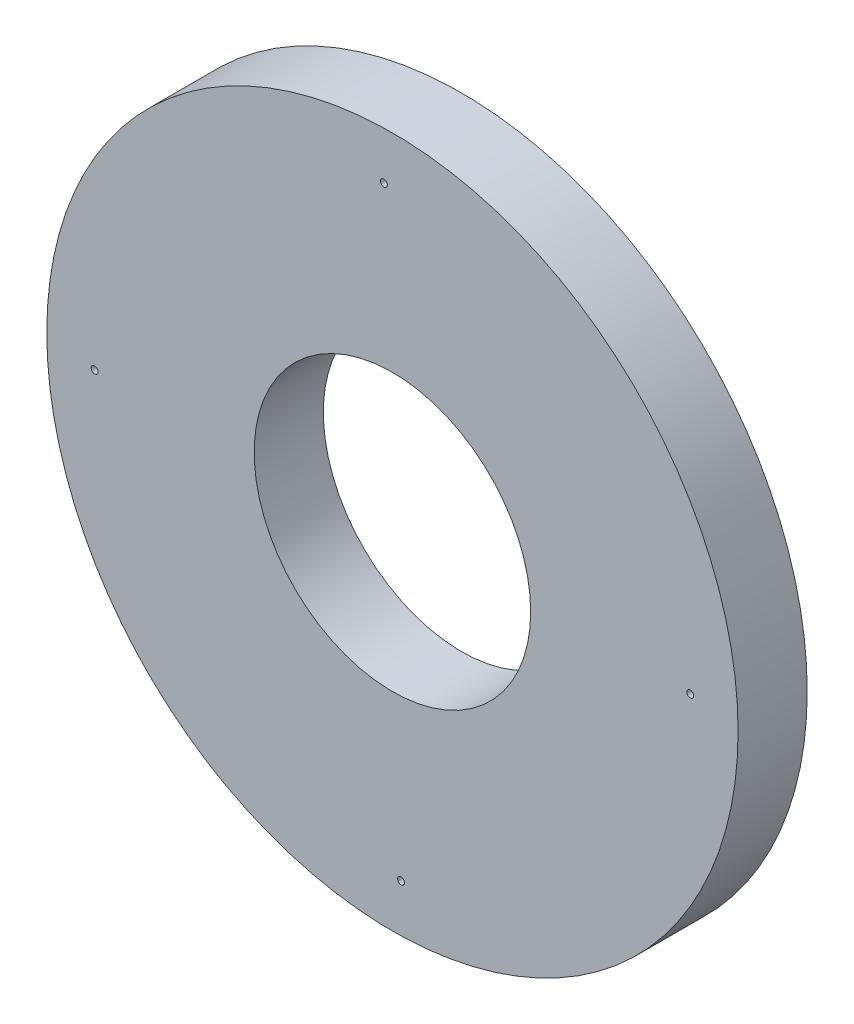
ISO-10303-21;
HEADER;
FILE_DESCRIPTION(('STEP AP214'),'2;1');
FILE_NAME('part.step','',(''),(''),'','','');
FILE_SCHEMA(('AUTOMOTIVE_DESIGN { 1 0 10303 214 1 1 1 1 }'));
ENDSEC;
DATA;
#1=APPLICATION_CONTEXT('core data for automotive mechanical design processes');
#2=APPLICATION_PROTOCOL_DEFINITION('international standard','automotive_design',2000,#1);
#3=PRODUCT_CONTEXT('',#1,'mechanical');
#4=PRODUCT('Part','Part','',(#3));
#5=PRODUCT_RELATED_PRODUCT_CATEGORY('part','',(#4));
#6=PRODUCT_DEFINITION_FORMATION('','',#4);
#7=PRODUCT_DEFINITION_CONTEXT('part definition',#1,'design');
#8=PRODUCT_DEFINITION('design','',#6,#7);
#9=PRODUCT_DEFINITION_SHAPE('','',#8);
#10=(LENGTH_UNIT() NAMED_UNIT(*) SI_UNIT(.MILLI.,.METRE.));
#11=(NAMED_UNIT(*) PLANE_ANGLE_UNIT() SI_UNIT($,.RADIAN.));
#12=(NAMED_UNIT(*) SI_UNIT($,.STERADIAN.) SOLID_ANGLE_UNIT());
#13=UNCERTAINTY_MEASURE_WITH_UNIT(LENGTH_MEASURE(1.E-05),#10,'distance_accuracy_value','');
#14=(GEOMETRIC_REPRESENTATION_CONTEXT(3) GLOBAL_UNCERTAINTY_ASSIGNED_CONTEXT((#13)) GLOBAL_UNIT_ASSIGNED_CONTEXT((#10,
#11,#12)) REPRESENTATION_CONTEXT('',''));
#15=CARTESIAN_POINT('',(0.,0.,0.));
#16=DIRECTION('',(0.,0.,1.));
#17=DIRECTION('',(1.,0.,0.));
#18=AXIS2_PLACEMENT_3D('',#15,#16,#17);
#19=CARTESIAN_POINT('',(-8.36808169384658,3.175,6.35));
#20=DIRECTION('',(0.,0.,1.));
#21=DIRECTION('',(1.,0.,0.));
#22=AXIS2_PLACEMENT_3D('',#19,#20,#21);
#23=PLANE('',#22);
#24=CARTESIAN_POINT('',(-9.15683678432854,30.5321317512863,6.35));
#25=DIRECTION('',(0.,0.,1.));
#26=DIRECTION('',(1.,0.,0.));
#27=AXIS2_PLACEMENT_3D('',#24,#25,#26);
#28=CIRCLE('',#27,0.317500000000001);
#29=CARTESIAN_POINT('',(-8.83933678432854,30.5321317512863,6.35));
#30=VERTEX_POINT('',#29);
#31=EDGE_CURVE('E59',#30,#30,#28,.T.);
#32=ORIENTED_EDGE('',*,*,#31,.F.);
#33=EDGE_LOOP('',(#32));
#34=FACE_BOUND('',#33,.T.);
#35=CARTESIAN_POINT('',(-7.57932660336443,-24.1821317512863,6.35));
#36=DIRECTION('',(0.,0.,1.));
#37=DIRECTION('',(1.,0.,0.));
#38=AXIS2_PLACEMENT_3D('',#35,#36,#37);
#39=CIRCLE('',#38,0.317500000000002);
#40=CARTESIAN_POINT('',(-7.26182660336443,-24.1821317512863,6.35));
#41=VERTEX_POINT('',#40);
#42=EDGE_CURVE('E47',#41,#41,#39,.T.);
#43=ORIENTED_EDGE('',*,*,#42,.F.);
#44=EDGE_LOOP('',(#43));
#45=FACE_BOUND('',#44,.T.);
#46=CARTESIAN_POINT('',(-8.36808169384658,3.175,6.35));
#47=DIRECTION('',(0.,0.,1.));
#48=DIRECTION('',(1.,0.,0.));
#49=AXIS2_PLACEMENT_3D('',#46,#47,#48);
#50=CIRCLE('',#49,31.75);
#51=CARTESIAN_POINT('',(23.3819183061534,3.175,6.35));
#52=VERTEX_POINT('',#51);
#53=EDGE_CURVE('E10',#52,#52,#50,.T.);
#54=ORIENTED_EDGE('',*,*,#53,.T.);
#55=EDGE_LOOP('',(#54));
#56=FACE_BOUND('',#55,.T.);
#57=CARTESIAN_POINT('',(-8.36808169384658,3.175,6.35));
#58=DIRECTION('',(0.,0.,1.));
#59=DIRECTION('',(1.,0.,0.));
#60=AXIS2_PLACEMENT_3D('',#57,#58,#59);
#61=CIRCLE('',#60,12.7);
#62=CARTESIAN_POINT('',(4.33191830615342,3.175,6.35));
#63=VERTEX_POINT('',#62);
#64=EDGE_CURVE('E42',#63,#63,#61,.T.);
#65=ORIENTED_EDGE('',*,*,#64,.F.);
#66=EDGE_LOOP('',(#65));
#67=FACE_BOUND('',#66,.T.);
#68=CARTESIAN_POINT('',(-35.7252134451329,2.38624490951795,6.35));
#69=DIRECTION('',(0.,0.,1.));
#70=DIRECTION('',(1.,0.,0.));
#71=AXIS2_PLACEMENT_3D('',#68,#69,#70);
#72=CIRCLE('',#71,0.317500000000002);
#73=CARTESIAN_POINT('',(-35.4077134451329,2.38624490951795,6.35));
#74=VERTEX_POINT('',#73);
#75=EDGE_CURVE('E53',#74,#74,#72,.T.);
#76=ORIENTED_EDGE('',*,*,#75,.F.);
#77=EDGE_LOOP('',(#76));
#78=FACE_BOUND('',#77,.T.);
#79=CARTESIAN_POINT('',(18.9890500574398,3.96375509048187,6.35));
#80=DIRECTION('',(0.,0.,1.));
#81=DIRECTION('',(1.,0.,0.));
#82=AXIS2_PLACEMENT_3D('',#79,#80,#81);
#83=CIRCLE('',#82,0.317500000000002);
#84=CARTESIAN_POINT('',(19.3065500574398,3.96375509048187,6.35));
#85=VERTEX_POINT('',#84);
#86=EDGE_CURVE('E65',#85,#85,#83,.T.);
#87=ORIENTED_EDGE('',*,*,#86,.F.);
#88=EDGE_LOOP('',(#87));
#89=FACE_BOUND('',#88,.T.);
#90=ADVANCED_FACE('F31',(#34,#45,#56,#67,#78,#89),#23,.T.);
#91=CARTESIAN_POINT('',(-8.36808169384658,3.175,0.));
#92=DIRECTION('',(0.,0.,1.));
#93=DIRECTION('',(1.,0.,0.));
#94=AXIS2_PLACEMENT_3D('',#91,#92,#93);
#95=PLANE('',#94);
#96=CARTESIAN_POINT('',(-9.15683678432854,30.5321317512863,0.));
#97=DIRECTION('',(0.,0.,1.));
#98=DIRECTION('',(1.,0.,0.));
#99=AXIS2_PLACEMENT_3D('',#96,#97,#98);
#100=CIRCLE('',#99,0.317500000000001);
#101=CARTESIAN_POINT('',(-8.83933678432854,30.5321317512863,0.));
#102=VERTEX_POINT('',#101);
#103=EDGE_CURVE('E62',#102,#102,#100,.T.);
#104=ORIENTED_EDGE('',*,*,#103,.T.);
#105=EDGE_LOOP('',(#104));
#106=FACE_BOUND('',#105,.T.);
#107=CARTESIAN_POINT('',(-7.57932660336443,-24.1821317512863,0.));
#108=DIRECTION('',(0.,0.,1.));
#109=DIRECTION('',(1.,0.,0.));
#110=AXIS2_PLACEMENT_3D('',#107,#108,#109);
#111=CIRCLE('',#110,0.317500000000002);
#112=CARTESIAN_POINT('',(-7.26182660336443,-24.1821317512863,0.));
#113=VERTEX_POINT('',#112);
#114=EDGE_CURVE('E50',#113,#113,#111,.T.);
#115=ORIENTED_EDGE('',*,*,#114,.T.);
#116=EDGE_LOOP('',(#115));
#117=FACE_BOUND('',#116,.T.);
#118=CARTESIAN_POINT('',(-8.36808169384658,3.175,0.));
#119=DIRECTION('',(0.,0.,1.));
#120=DIRECTION('',(1.,0.,0.));
#121=AXIS2_PLACEMENT_3D('',#118,#119,#120);
#122=CIRCLE('',#121,31.75);
#123=CARTESIAN_POINT('',(23.3819183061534,3.175,0.));
#124=VERTEX_POINT('',#123);
#125=EDGE_CURVE('E35',#124,#124,#122,.T.);
#126=ORIENTED_EDGE('',*,*,#125,.F.);
#127=EDGE_LOOP('',(#126));
#128=FACE_BOUND('',#127,.T.);
#129=CARTESIAN_POINT('',(-8.36808169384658,3.175,0.));
#130=DIRECTION('',(0.,0.,1.));
#131=DIRECTION('',(1.,0.,0.));
#132=AXIS2_PLACEMENT_3D('',#129,#130,#131);
#133=CIRCLE('',#132,12.7);
#134=CARTESIAN_POINT('',(4.33191830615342,3.175,0.));
#135=VERTEX_POINT('',#134);
#136=EDGE_CURVE('E44',#135,#135,#133,.T.);
#137=ORIENTED_EDGE('',*,*,#136,.T.);
#138=EDGE_LOOP('',(#137));
#139=FACE_BOUND('',#138,.T.);
#140=CARTESIAN_POINT('',(-35.7252134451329,2.38624490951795,0.));
#141=DIRECTION('',(0.,0.,1.));
#142=DIRECTION('',(1.,0.,0.));
#143=AXIS2_PLACEMENT_3D('',#140,#141,#142);
#144=CIRCLE('',#143,0.317500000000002);
#145=CARTESIAN_POINT('',(-35.4077134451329,2.38624490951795,0.));
#146=VERTEX_POINT('',#145);
#147=EDGE_CURVE('E56',#146,#146,#144,.T.);
#148=ORIENTED_EDGE('',*,*,#147,.T.);
#149=EDGE_LOOP('',(#148));
#150=FACE_BOUND('',#149,.T.);
#151=CARTESIAN_POINT('',(18.9890500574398,3.96375509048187,0.));
#152=DIRECTION('',(0.,0.,1.));
#153=DIRECTION('',(1.,0.,0.));
#154=AXIS2_PLACEMENT_3D('',#151,#152,#153);
#155=CIRCLE('',#154,0.317500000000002);
#156=CARTESIAN_POINT('',(19.3065500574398,3.96375509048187,0.));
#157=VERTEX_POINT('',#156);
#158=EDGE_CURVE('E68',#157,#157,#155,.T.);
#159=ORIENTED_EDGE('',*,*,#158,.T.);
#160=EDGE_LOOP('',(#159));
#161=FACE_BOUND('',#160,.T.);
#162=ADVANCED_FACE('F78',(#106,#117,#128,#139,#150,#161),#95,.F.);
#163=CARTESIAN_POINT('',(-8.36808169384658,3.175,6.35));
#164=DIRECTION('',(0.,0.,-1.));
#165=DIRECTION('',(-1.,0.,0.));
#166=AXIS2_PLACEMENT_3D('',#163,#164,#165);
#167=CYLINDRICAL_SURFACE('',#166,31.75);
#168=ORIENTED_EDGE('',*,*,#53,.F.);
#169=EDGE_LOOP('',(#168));
#170=FACE_BOUND('',#169,.T.);
#171=ORIENTED_EDGE('',*,*,#125,.T.);
#172=EDGE_LOOP('',(#171));
#173=FACE_BOUND('',#172,.T.);
#174=ADVANCED_FACE('F33',(#170,#173),#167,.T.);
#175=CARTESIAN_POINT('',(-8.36808169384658,3.175,6.35));
#176=DIRECTION('',(0.,0.,-1.));
#177=DIRECTION('',(-1.,0.,0.));
#178=AXIS2_PLACEMENT_3D('',#175,#176,#177);
#179=CYLINDRICAL_SURFACE('',#178,12.7);
#180=ORIENTED_EDGE('',*,*,#64,.T.);
#181=EDGE_LOOP('',(#180));
#182=FACE_BOUND('',#181,.T.);
#183=ORIENTED_EDGE('',*,*,#136,.F.);
#184=EDGE_LOOP('',(#183));
#185=FACE_BOUND('',#184,.T.);
#186=ADVANCED_FACE('F88',(#182,#185),#179,.F.);
#187=CARTESIAN_POINT('',(-7.57932660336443,-24.1821317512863,6.35));
#188=DIRECTION('',(0.,0.,-1.));
#189=DIRECTION('',(-1.,0.,0.));
#190=AXIS2_PLACEMENT_3D('',#187,#188,#189);
#191=CYLINDRICAL_SURFACE('',#190,0.317500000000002);
#192=ORIENTED_EDGE('',*,*,#42,.T.);
#193=EDGE_LOOP('',(#192));
#194=FACE_BOUND('',#193,.T.);
#195=ORIENTED_EDGE('',*,*,#114,.F.);
#196=EDGE_LOOP('',(#195));
#197=FACE_BOUND('',#196,.T.);
#198=ADVANCED_FACE('F91',(#194,#197),#191,.F.);
#199=CARTESIAN_POINT('',(-35.7252134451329,2.38624490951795,6.35));
#200=DIRECTION('',(0.,0.,-1.));
#201=DIRECTION('',(-1.,0.,0.));
#202=AXIS2_PLACEMENT_3D('',#199,#200,#201);
#203=CYLINDRICAL_SURFACE('',#202,0.317500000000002);
#204=ORIENTED_EDGE('',*,*,#75,.T.);
#205=EDGE_LOOP('',(#204));
#206=FACE_BOUND('',#205,.T.);
#207=ORIENTED_EDGE('',*,*,#147,.F.);
#208=EDGE_LOOP('',(#207));
#209=FACE_BOUND('',#208,.T.);
#210=ADVANCED_FACE('F95',(#206,#209),#203,.F.);
#211=CARTESIAN_POINT('',(-9.15683678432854,30.5321317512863,6.35));
#212=DIRECTION('',(0.,0.,-1.));
#213=DIRECTION('',(-1.,0.,0.));
#214=AXIS2_PLACEMENT_3D('',#211,#212,#213);
#215=CYLINDRICAL_SURFACE('',#214,0.317500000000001);
#216=ORIENTED_EDGE('',*,*,#31,.T.);
#217=EDGE_LOOP('',(#216));
#218=FACE_BOUND('',#217,.T.);
#219=ORIENTED_EDGE('',*,*,#103,.F.);
#220=EDGE_LOOP('',(#219));
#221=FACE_BOUND('',#220,.T.);
#222=ADVANCED_FACE('F99',(#218,#221),#215,.F.);
#223=CARTESIAN_POINT('',(18.9890500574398,3.96375509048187,6.35));
#224=DIRECTION('',(0.,0.,-1.));
#225=DIRECTION('',(-1.,0.,0.));
#226=AXIS2_PLACEMENT_3D('',#223,#224,#225);
#227=CYLINDRICAL_SURFACE('',#226,0.317500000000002);
#228=ORIENTED_EDGE('',*,*,#86,.T.);
#229=EDGE_LOOP('',(#228));
#230=FACE_BOUND('',#229,.T.);
#231=ORIENTED_EDGE('',*,*,#158,.F.);
#232=EDGE_LOOP('',(#231));
#233=FACE_BOUND('',#232,.T.);
#234=ADVANCED_FACE('F74',(#230,#233),#227,.F.);
#235=CLOSED_SHELL('',(#90,#162,#174,#186,#198,#210,#222,#234));
#236=MANIFOLD_SOLID_BREP('B2',#235);
#237=ADVANCED_BREP_SHAPE_REPRESENTATION('',(#18,#236),#14);
#238=SHAPE_DEFINITION_REPRESENTATION(#9,#237);
ENDSEC;
END-ISO-10303-21;
